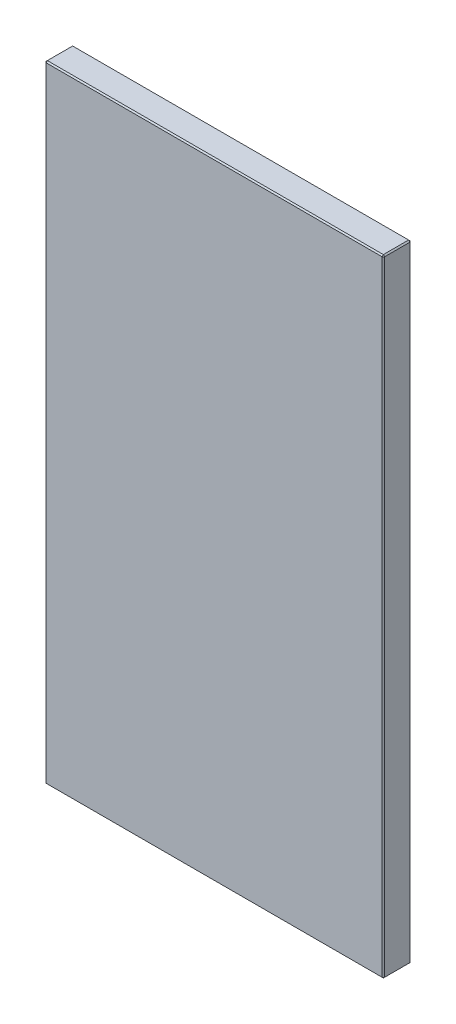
ISO-10303-21;
HEADER;
FILE_DESCRIPTION(('STEP AP214'),'2;1');
FILE_NAME('part.step','',(''),(''),'','','');
FILE_SCHEMA(('AUTOMOTIVE_DESIGN { 1 0 10303 214 1 1 1 1 }'));
ENDSEC;
DATA;
#1=APPLICATION_CONTEXT('core data for automotive mechanical design processes');
#2=APPLICATION_PROTOCOL_DEFINITION('international standard','automotive_design',2000,#1);
#3=PRODUCT_CONTEXT('',#1,'mechanical');
#4=PRODUCT('Part','Part','',(#3));
#5=PRODUCT_RELATED_PRODUCT_CATEGORY('part','',(#4));
#6=PRODUCT_DEFINITION_FORMATION('','',#4);
#7=PRODUCT_DEFINITION_CONTEXT('part definition',#1,'design');
#8=PRODUCT_DEFINITION('design','',#6,#7);
#9=PRODUCT_DEFINITION_SHAPE('','',#8);
#10=(LENGTH_UNIT() NAMED_UNIT(*) SI_UNIT(.MILLI.,.METRE.));
#11=(NAMED_UNIT(*) PLANE_ANGLE_UNIT() SI_UNIT($,.RADIAN.));
#12=(NAMED_UNIT(*) SI_UNIT($,.STERADIAN.) SOLID_ANGLE_UNIT());
#13=UNCERTAINTY_MEASURE_WITH_UNIT(LENGTH_MEASURE(1.E-05),#10,'distance_accuracy_value','');
#14=(GEOMETRIC_REPRESENTATION_CONTEXT(3) GLOBAL_UNCERTAINTY_ASSIGNED_CONTEXT((#13)) GLOBAL_UNIT_ASSIGNED_CONTEXT((#10,
#11,#12)) REPRESENTATION_CONTEXT('',''));
#15=CARTESIAN_POINT('',(0.,0.,0.));
#16=DIRECTION('',(0.,0.,1.));
#17=DIRECTION('',(1.,0.,0.));
#18=AXIS2_PLACEMENT_3D('',#15,#16,#17);
#19=CARTESIAN_POINT('',(-134.,-248.,22.));
#20=DIRECTION('',(1.,0.,0.));
#21=DIRECTION('',(0.,0.,-1.));
#22=AXIS2_PLACEMENT_3D('',#19,#20,#21);
#23=PLANE('',#22);
#24=DIRECTION('',(0.,0.,-1.));
#25=VECTOR('',#24,1.);
#26=CARTESIAN_POINT('',(-134.,247.,22.));
#27=LINE('',#26,#25);
#28=CARTESIAN_POINT('',(-134.,247.,21.));
#29=VERTEX_POINT('',#28);
#30=CARTESIAN_POINT('',(-134.,247.,1.));
#31=VERTEX_POINT('',#30);
#32=EDGE_CURVE('E114',#29,#31,#27,.T.);
#33=ORIENTED_EDGE('',*,*,#32,.T.);
#34=DIRECTION('',(0.,-1.,0.));
#35=VECTOR('',#34,1.);
#36=CARTESIAN_POINT('',(-134.,-248.,1.));
#37=LINE('',#36,#35);
#38=CARTESIAN_POINT('',(-134.,-247.,1.));
#39=VERTEX_POINT('',#38);
#40=EDGE_CURVE('E110',#31,#39,#37,.T.);
#41=ORIENTED_EDGE('',*,*,#40,.T.);
#42=DIRECTION('',(0.,0.,1.));
#43=VECTOR('',#42,1.);
#44=CARTESIAN_POINT('',(-134.,-247.,22.));
#45=LINE('',#44,#43);
#46=CARTESIAN_POINT('',(-134.,-247.,21.));
#47=VERTEX_POINT('',#46);
#48=EDGE_CURVE('E103',#39,#47,#45,.T.);
#49=ORIENTED_EDGE('',*,*,#48,.T.);
#50=DIRECTION('',(0.,1.,0.));
#51=VECTOR('',#50,1.);
#52=CARTESIAN_POINT('',(-134.,248.,21.));
#53=LINE('',#52,#51);
#54=EDGE_CURVE('E107',#47,#29,#53,.T.);
#55=ORIENTED_EDGE('',*,*,#54,.T.);
#56=EDGE_LOOP('',(#33,#41,#49,#55));
#57=FACE_BOUND('',#56,.T.);
#58=ADVANCED_FACE('F15',(#57),#23,.F.);
#59=CARTESIAN_POINT('',(134.,-248.,22.));
#60=DIRECTION('',(0.,1.,0.));
#61=DIRECTION('',(-1.,0.,0.));
#62=AXIS2_PLACEMENT_3D('',#59,#60,#61);
#63=PLANE('',#62);
#64=DIRECTION('',(0.,0.,-1.));
#65=VECTOR('',#64,1.);
#66=CARTESIAN_POINT('',(-133.,-248.,22.));
#67=LINE('',#66,#65);
#68=CARTESIAN_POINT('',(-133.,-248.,21.));
#69=VERTEX_POINT('',#68);
#70=CARTESIAN_POINT('',(-133.,-248.,1.));
#71=VERTEX_POINT('',#70);
#72=EDGE_CURVE('E122',#69,#71,#67,.T.);
#73=ORIENTED_EDGE('',*,*,#72,.T.);
#74=DIRECTION('',(1.,0.,0.));
#75=VECTOR('',#74,1.);
#76=CARTESIAN_POINT('',(134.,-248.,1.));
#77=LINE('',#76,#75);
#78=CARTESIAN_POINT('',(133.,-248.,1.));
#79=VERTEX_POINT('',#78);
#80=EDGE_CURVE('E160',#71,#79,#77,.T.);
#81=ORIENTED_EDGE('',*,*,#80,.T.);
#82=DIRECTION('',(0.,0.,1.));
#83=VECTOR('',#82,1.);
#84=CARTESIAN_POINT('',(133.,-248.,22.));
#85=LINE('',#84,#83);
#86=CARTESIAN_POINT('',(133.,-248.,21.));
#87=VERTEX_POINT('',#86);
#88=EDGE_CURVE('E157',#79,#87,#85,.T.);
#89=ORIENTED_EDGE('',*,*,#88,.T.);
#90=DIRECTION('',(-1.,0.,0.));
#91=VECTOR('',#90,1.);
#92=CARTESIAN_POINT('',(-134.,-248.,21.));
#93=LINE('',#92,#91);
#94=EDGE_CURVE('E155',#87,#69,#93,.T.);
#95=ORIENTED_EDGE('',*,*,#94,.T.);
#96=EDGE_LOOP('',(#73,#81,#89,#95));
#97=FACE_BOUND('',#96,.T.);
#98=ADVANCED_FACE('F277',(#97),#63,.F.);
#99=CARTESIAN_POINT('',(134.,-248.,22.));
#100=DIRECTION('',(-1.,0.,0.));
#101=DIRECTION('',(0.,0.,1.));
#102=AXIS2_PLACEMENT_3D('',#99,#100,#101);
#103=PLANE('',#102);
#104=DIRECTION('',(0.,-1.,0.));
#105=VECTOR('',#104,1.);
#106=CARTESIAN_POINT('',(134.,-248.,21.));
#107=LINE('',#106,#105);
#108=CARTESIAN_POINT('',(134.,247.,21.));
#109=VERTEX_POINT('',#108);
#110=CARTESIAN_POINT('',(134.,-247.,21.));
#111=VERTEX_POINT('',#110);
#112=EDGE_CURVE('E162',#109,#111,#107,.T.);
#113=ORIENTED_EDGE('',*,*,#112,.T.);
#114=DIRECTION('',(0.,0.,-1.));
#115=VECTOR('',#114,1.);
#116=CARTESIAN_POINT('',(134.,-247.,22.));
#117=LINE('',#116,#115);
#118=CARTESIAN_POINT('',(134.,-247.,1.));
#119=VERTEX_POINT('',#118);
#120=EDGE_CURVE('E168',#111,#119,#117,.T.);
#121=ORIENTED_EDGE('',*,*,#120,.T.);
#122=DIRECTION('',(0.,1.,0.));
#123=VECTOR('',#122,1.);
#124=CARTESIAN_POINT('',(134.,-248.,1.));
#125=LINE('',#124,#123);
#126=CARTESIAN_POINT('',(134.,247.,1.));
#127=VERTEX_POINT('',#126);
#128=EDGE_CURVE('E166',#119,#127,#125,.T.);
#129=ORIENTED_EDGE('',*,*,#128,.T.);
#130=DIRECTION('',(0.,0.,1.));
#131=VECTOR('',#130,1.);
#132=CARTESIAN_POINT('',(134.,247.,22.));
#133=LINE('',#132,#131);
#134=EDGE_CURVE('E164',#127,#109,#133,.T.);
#135=ORIENTED_EDGE('',*,*,#134,.T.);
#136=EDGE_LOOP('',(#113,#121,#129,#135));
#137=FACE_BOUND('',#136,.T.);
#138=ADVANCED_FACE('F254',(#137),#103,.F.);
#139=CARTESIAN_POINT('',(134.,248.,22.));
#140=DIRECTION('',(0.,-1.,0.));
#141=DIRECTION('',(1.,0.,0.));
#142=AXIS2_PLACEMENT_3D('',#139,#140,#141);
#143=PLANE('',#142);
#144=DIRECTION('',(-1.,0.,0.));
#145=VECTOR('',#144,1.);
#146=CARTESIAN_POINT('',(134.,248.,1.));
#147=LINE('',#146,#145);
#148=CARTESIAN_POINT('',(133.,248.,1.));
#149=VERTEX_POINT('',#148);
#150=CARTESIAN_POINT('',(-133.,248.,1.));
#151=VERTEX_POINT('',#150);
#152=EDGE_CURVE('E150',#149,#151,#147,.T.);
#153=ORIENTED_EDGE('',*,*,#152,.T.);
#154=DIRECTION('',(0.,0.,1.));
#155=VECTOR('',#154,1.);
#156=CARTESIAN_POINT('',(-133.,248.,22.));
#157=LINE('',#156,#155);
#158=CARTESIAN_POINT('',(-133.,248.,21.));
#159=VERTEX_POINT('',#158);
#160=EDGE_CURVE('E152',#151,#159,#157,.T.);
#161=ORIENTED_EDGE('',*,*,#160,.T.);
#162=DIRECTION('',(1.,0.,0.));
#163=VECTOR('',#162,1.);
#164=CARTESIAN_POINT('',(134.,248.,21.));
#165=LINE('',#164,#163);
#166=CARTESIAN_POINT('',(133.,248.,21.));
#167=VERTEX_POINT('',#166);
#168=EDGE_CURVE('E146',#159,#167,#165,.T.);
#169=ORIENTED_EDGE('',*,*,#168,.T.);
#170=DIRECTION('',(0.,0.,-1.));
#171=VECTOR('',#170,1.);
#172=CARTESIAN_POINT('',(133.,248.,22.));
#173=LINE('',#172,#171);
#174=EDGE_CURVE('E148',#167,#149,#173,.T.);
#175=ORIENTED_EDGE('',*,*,#174,.T.);
#176=EDGE_LOOP('',(#153,#161,#169,#175));
#177=FACE_BOUND('',#176,.T.);
#178=ADVANCED_FACE('F286',(#177),#143,.F.);
#179=CARTESIAN_POINT('',(0.,0.,22.));
#180=DIRECTION('',(0.,0.,1.));
#181=DIRECTION('',(1.,0.,0.));
#182=AXIS2_PLACEMENT_3D('',#179,#180,#181);
#183=PLANE('',#182);
#184=DIRECTION('',(0.,1.,0.));
#185=VECTOR('',#184,1.);
#186=CARTESIAN_POINT('',(133.,248.,22.));
#187=LINE('',#186,#185);
#188=CARTESIAN_POINT('',(133.,-247.,22.));
#189=VERTEX_POINT('',#188);
#190=CARTESIAN_POINT('',(133.,247.,22.));
#191=VERTEX_POINT('',#190);
#192=EDGE_CURVE('E24',#189,#191,#187,.T.);
#193=ORIENTED_EDGE('',*,*,#192,.T.);
#194=DIRECTION('',(-1.,0.,0.));
#195=VECTOR('',#194,1.);
#196=CARTESIAN_POINT('',(-134.,247.,22.));
#197=LINE('',#196,#195);
#198=CARTESIAN_POINT('',(-133.,247.,22.));
#199=VERTEX_POINT('',#198);
#200=EDGE_CURVE('E9',#191,#199,#197,.T.);
#201=ORIENTED_EDGE('',*,*,#200,.T.);
#202=DIRECTION('',(0.,-1.,0.));
#203=VECTOR('',#202,1.);
#204=CARTESIAN_POINT('',(-133.,-248.,22.));
#205=LINE('',#204,#203);
#206=CARTESIAN_POINT('',(-133.,-247.,22.));
#207=VERTEX_POINT('',#206);
#208=EDGE_CURVE('E180',#199,#207,#205,.T.);
#209=ORIENTED_EDGE('',*,*,#208,.T.);
#210=DIRECTION('',(1.,0.,0.));
#211=VECTOR('',#210,1.);
#212=CARTESIAN_POINT('',(134.,-247.,22.));
#213=LINE('',#212,#211);
#214=EDGE_CURVE('E35',#207,#189,#213,.T.);
#215=ORIENTED_EDGE('',*,*,#214,.T.);
#216=EDGE_LOOP('',(#193,#201,#209,#215));
#217=FACE_BOUND('',#216,.T.);
#218=ADVANCED_FACE('F351',(#217),#183,.T.);
#219=CARTESIAN_POINT('',(0.,0.,0.));
#220=DIRECTION('',(0.,0.,1.));
#221=DIRECTION('',(1.,0.,0.));
#222=AXIS2_PLACEMENT_3D('',#219,#220,#221);
#223=PLANE('',#222);
#224=DIRECTION('',(0.,-1.,0.));
#225=VECTOR('',#224,1.);
#226=CARTESIAN_POINT('',(133.,0.,0.));
#227=LINE('',#226,#225);
#228=CARTESIAN_POINT('',(133.,247.,0.));
#229=VERTEX_POINT('',#228);
#230=CARTESIAN_POINT('',(133.,-247.,0.));
#231=VERTEX_POINT('',#230);
#232=EDGE_CURVE('E175',#229,#231,#227,.T.);
#233=ORIENTED_EDGE('',*,*,#232,.T.);
#234=DIRECTION('',(-1.,0.,0.));
#235=VECTOR('',#234,1.);
#236=CARTESIAN_POINT('',(0.,-247.,0.));
#237=LINE('',#236,#235);
#238=CARTESIAN_POINT('',(-133.,-247.,0.));
#239=VERTEX_POINT('',#238);
#240=EDGE_CURVE('E177',#231,#239,#237,.T.);
#241=ORIENTED_EDGE('',*,*,#240,.T.);
#242=DIRECTION('',(0.,1.,0.));
#243=VECTOR('',#242,1.);
#244=CARTESIAN_POINT('',(-133.,0.,0.));
#245=LINE('',#244,#243);
#246=CARTESIAN_POINT('',(-133.,247.,0.));
#247=VERTEX_POINT('',#246);
#248=EDGE_CURVE('E173',#239,#247,#245,.T.);
#249=ORIENTED_EDGE('',*,*,#248,.T.);
#250=DIRECTION('',(1.,0.,0.));
#251=VECTOR('',#250,1.);
#252=CARTESIAN_POINT('',(0.,247.,0.));
#253=LINE('',#252,#251);
#254=EDGE_CURVE('E171',#247,#229,#253,.T.);
#255=ORIENTED_EDGE('',*,*,#254,.T.);
#256=EDGE_LOOP('',(#233,#241,#249,#255));
#257=FACE_BOUND('',#256,.T.);
#258=ADVANCED_FACE('F246',(#257),#223,.F.);
#259=CARTESIAN_POINT('',(134.,-247.,22.));
#260=DIRECTION('',(-0.707106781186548,0.707106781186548,0.));
#261=DIRECTION('',(0.,0.,-1.));
#262=AXIS2_PLACEMENT_3D('',#259,#260,#261);
#263=PLANE('',#262);
#264=DIRECTION('',(-0.707106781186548,-0.707106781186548,0.));
#265=VECTOR('',#264,1.);
#266=CARTESIAN_POINT('',(133.,-248.,21.));
#267=LINE('',#266,#265);
#268=EDGE_CURVE('E19',#87,#111,#267,.F.);
#269=ORIENTED_EDGE('',*,*,#268,.F.);
#270=ORIENTED_EDGE('',*,*,#88,.F.);
#271=DIRECTION('',(0.707106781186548,0.707106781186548,0.));
#272=VECTOR('',#271,1.);
#273=CARTESIAN_POINT('',(134.,-247.,1.));
#274=LINE('',#273,#272);
#275=EDGE_CURVE('E142',#119,#79,#274,.F.);
#276=ORIENTED_EDGE('',*,*,#275,.F.);
#277=ORIENTED_EDGE('',*,*,#120,.F.);
#278=EDGE_LOOP('',(#269,#270,#276,#277));
#279=FACE_BOUND('',#278,.T.);
#280=ADVANCED_FACE('F17',(#279),#263,.F.);
#281=CARTESIAN_POINT('',(133.,-248.,21.));
#282=DIRECTION('',(0.577350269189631,-0.577350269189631,0.577350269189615));
#283=DIRECTION('',(0.707106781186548,0.707106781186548,0.));
#284=AXIS2_PLACEMENT_3D('',#281,#282,#283);
#285=PLANE('',#284);
#286=DIRECTION('',(0.,-0.707106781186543,-0.707106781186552));
#287=VECTOR('',#286,1.);
#288=CARTESIAN_POINT('',(133.,-248.,21.));
#289=LINE('',#288,#287);
#290=EDGE_CURVE('E227',#87,#189,#289,.F.);
#291=ORIENTED_EDGE('',*,*,#290,.F.);
#292=ORIENTED_EDGE('',*,*,#268,.T.);
#293=DIRECTION('',(-0.707106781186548,0.,0.707106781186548));
#294=VECTOR('',#293,1.);
#295=CARTESIAN_POINT('',(133.5,-247.,21.5));
#296=LINE('',#295,#294);
#297=EDGE_CURVE('E229',#189,#111,#296,.F.);
#298=ORIENTED_EDGE('',*,*,#297,.F.);
#299=EDGE_LOOP('',(#291,#292,#298));
#300=FACE_BOUND('',#299,.T.);
#301=ADVANCED_FACE('F272',(#300),#285,.T.);
#302=CARTESIAN_POINT('',(134.,-247.,1.));
#303=DIRECTION('',(0.577350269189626,-0.577350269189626,-0.577350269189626));
#304=DIRECTION('',(-0.707106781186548,0.,-0.707106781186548));
#305=AXIS2_PLACEMENT_3D('',#302,#303,#304);
#306=PLANE('',#305);
#307=DIRECTION('',(-0.707106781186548,0.,-0.707106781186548));
#308=VECTOR('',#307,1.);
#309=CARTESIAN_POINT('',(134.,-247.,1.));
#310=LINE('',#309,#308);
#311=EDGE_CURVE('E221',#119,#231,#310,.T.);
#312=ORIENTED_EDGE('',*,*,#311,.F.);
#313=ORIENTED_EDGE('',*,*,#275,.T.);
#314=DIRECTION('',(0.,-0.707106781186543,0.707106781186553));
#315=VECTOR('',#314,1.);
#316=CARTESIAN_POINT('',(133.,-247.5,0.500000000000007));
#317=LINE('',#316,#315);
#318=EDGE_CURVE('E224',#231,#79,#317,.T.);
#319=ORIENTED_EDGE('',*,*,#318,.F.);
#320=EDGE_LOOP('',(#312,#313,#319));
#321=FACE_BOUND('',#320,.T.);
#322=ADVANCED_FACE('F236',(#321),#306,.T.);
#323=CARTESIAN_POINT('',(133.,0.,22.));
#324=DIRECTION('',(0.707106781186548,0.,0.707106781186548));
#325=DIRECTION('',(0.,-1.,0.));
#326=AXIS2_PLACEMENT_3D('',#323,#324,#325);
#327=PLANE('',#326);
#328=ORIENTED_EDGE('',*,*,#297,.T.);
#329=ORIENTED_EDGE('',*,*,#112,.F.);
#330=DIRECTION('',(0.707106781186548,0.,-0.707106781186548));
#331=VECTOR('',#330,1.);
#332=CARTESIAN_POINT('',(134.,247.,21.));
#333=LINE('',#332,#331);
#334=EDGE_CURVE('E215',#191,#109,#333,.T.);
#335=ORIENTED_EDGE('',*,*,#334,.F.);
#336=ORIENTED_EDGE('',*,*,#192,.F.);
#337=EDGE_LOOP('',(#328,#329,#335,#336));
#338=FACE_BOUND('',#337,.T.);
#339=ADVANCED_FACE('F267',(#338),#327,.T.);
#340=CARTESIAN_POINT('',(0.,-247.,22.));
#341=DIRECTION('',(0.,-0.707106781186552,0.707106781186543));
#342=DIRECTION('',(-1.,0.,0.));
#343=AXIS2_PLACEMENT_3D('',#340,#341,#342);
#344=PLANE('',#343);
#345=ORIENTED_EDGE('',*,*,#290,.T.);
#346=ORIENTED_EDGE('',*,*,#214,.F.);
#347=DIRECTION('',(0.,0.707106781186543,0.707106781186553));
#348=VECTOR('',#347,1.);
#349=CARTESIAN_POINT('',(-133.,-247.5,21.5));
#350=LINE('',#349,#348);
#351=EDGE_CURVE('E126',#69,#207,#350,.T.);
#352=ORIENTED_EDGE('',*,*,#351,.F.);
#353=ORIENTED_EDGE('',*,*,#94,.F.);
#354=EDGE_LOOP('',(#345,#346,#352,#353));
#355=FACE_BOUND('',#354,.T.);
#356=ADVANCED_FACE('F275',(#355),#344,.T.);
#357=CARTESIAN_POINT('',(-133.,-248.,22.));
#358=DIRECTION('',(0.707106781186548,0.707106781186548,0.));
#359=DIRECTION('',(0.,0.,-1.));
#360=AXIS2_PLACEMENT_3D('',#357,#358,#359);
#361=PLANE('',#360);
#362=DIRECTION('',(0.707106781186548,-0.707106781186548,0.));
#363=VECTOR('',#362,1.);
#364=CARTESIAN_POINT('',(-133.,-248.,1.));
#365=LINE('',#364,#363);
#366=EDGE_CURVE('E127',#71,#39,#365,.F.);
#367=ORIENTED_EDGE('',*,*,#366,.F.);
#368=ORIENTED_EDGE('',*,*,#72,.F.);
#369=DIRECTION('',(-0.707106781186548,0.707106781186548,0.));
#370=VECTOR('',#369,1.);
#371=CARTESIAN_POINT('',(-134.,-247.,21.));
#372=LINE('',#371,#370);
#373=EDGE_CURVE('E118',#47,#69,#372,.F.);
#374=ORIENTED_EDGE('',*,*,#373,.F.);
#375=ORIENTED_EDGE('',*,*,#48,.F.);
#376=EDGE_LOOP('',(#367,#368,#374,#375));
#377=FACE_BOUND('',#376,.T.);
#378=ADVANCED_FACE('F120',(#377),#361,.F.);
#379=CARTESIAN_POINT('',(134.,-248.,1.));
#380=DIRECTION('',(0.,0.707106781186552,0.707106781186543));
#381=DIRECTION('',(1.,0.,0.));
#382=AXIS2_PLACEMENT_3D('',#379,#380,#381);
#383=PLANE('',#382);
#384=ORIENTED_EDGE('',*,*,#318,.T.);
#385=ORIENTED_EDGE('',*,*,#80,.F.);
#386=DIRECTION('',(0.,0.707106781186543,-0.707106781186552));
#387=VECTOR('',#386,1.);
#388=CARTESIAN_POINT('',(-133.,-248.,1.));
#389=LINE('',#388,#387);
#390=EDGE_CURVE('E211',#239,#71,#389,.F.);
#391=ORIENTED_EDGE('',*,*,#390,.F.);
#392=ORIENTED_EDGE('',*,*,#240,.F.);
#393=EDGE_LOOP('',(#384,#385,#391,#392));
#394=FACE_BOUND('',#393,.T.);
#395=ADVANCED_FACE('F243',(#394),#383,.F.);
#396=CARTESIAN_POINT('',(134.,-248.,1.));
#397=DIRECTION('',(-0.707106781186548,0.,0.707106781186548));
#398=DIRECTION('',(0.,1.,0.));
#399=AXIS2_PLACEMENT_3D('',#396,#397,#398);
#400=PLANE('',#399);
#401=ORIENTED_EDGE('',*,*,#311,.T.);
#402=ORIENTED_EDGE('',*,*,#232,.F.);
#403=DIRECTION('',(0.707106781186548,0.,0.707106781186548));
#404=VECTOR('',#403,1.);
#405=CARTESIAN_POINT('',(134.,247.,1.));
#406=LINE('',#405,#404);
#407=EDGE_CURVE('E208',#127,#229,#406,.F.);
#408=ORIENTED_EDGE('',*,*,#407,.F.);
#409=ORIENTED_EDGE('',*,*,#128,.F.);
#410=EDGE_LOOP('',(#401,#402,#408,#409));
#411=FACE_BOUND('',#410,.T.);
#412=ADVANCED_FACE('F251',(#411),#400,.F.);
#413=CARTESIAN_POINT('',(133.,248.,22.));
#414=DIRECTION('',(-0.707106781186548,-0.707106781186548,0.));
#415=DIRECTION('',(0.,0.,-1.));
#416=AXIS2_PLACEMENT_3D('',#413,#414,#415);
#417=PLANE('',#416);
#418=DIRECTION('',(0.707106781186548,-0.707106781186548,0.));
#419=VECTOR('',#418,1.);
#420=CARTESIAN_POINT('',(134.,247.,21.));
#421=LINE('',#420,#419);
#422=EDGE_CURVE('E218',#109,#167,#421,.F.);
#423=ORIENTED_EDGE('',*,*,#422,.F.);
#424=ORIENTED_EDGE('',*,*,#134,.F.);
#425=DIRECTION('',(-0.707106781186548,0.707106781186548,0.));
#426=VECTOR('',#425,1.);
#427=CARTESIAN_POINT('',(134.,247.,1.));
#428=LINE('',#427,#426);
#429=EDGE_CURVE('E205',#149,#127,#428,.F.);
#430=ORIENTED_EDGE('',*,*,#429,.F.);
#431=ORIENTED_EDGE('',*,*,#174,.F.);
#432=EDGE_LOOP('',(#423,#424,#430,#431));
#433=FACE_BOUND('',#432,.T.);
#434=ADVANCED_FACE('F259',(#433),#417,.F.);
#435=CARTESIAN_POINT('',(134.,247.,21.));
#436=DIRECTION('',(0.577350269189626,0.577350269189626,0.577350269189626));
#437=DIRECTION('',(0.707106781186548,0.,-0.707106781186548));
#438=AXIS2_PLACEMENT_3D('',#435,#436,#437);
#439=PLANE('',#438);
#440=ORIENTED_EDGE('',*,*,#334,.T.);
#441=ORIENTED_EDGE('',*,*,#422,.T.);
#442=DIRECTION('',(0.,-0.707106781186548,0.707106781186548));
#443=VECTOR('',#442,1.);
#444=CARTESIAN_POINT('',(133.,247.5,21.5));
#445=LINE('',#444,#443);
#446=EDGE_CURVE('E134',#191,#167,#445,.F.);
#447=ORIENTED_EDGE('',*,*,#446,.F.);
#448=EDGE_LOOP('',(#440,#441,#447));
#449=FACE_BOUND('',#448,.T.);
#450=ADVANCED_FACE('F264',(#449),#439,.T.);
#451=CARTESIAN_POINT('',(-134.,-247.,21.));
#452=DIRECTION('',(-0.577350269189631,-0.577350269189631,0.577350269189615));
#453=DIRECTION('',(0.707106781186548,-0.707106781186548,0.));
#454=AXIS2_PLACEMENT_3D('',#451,#452,#453);
#455=PLANE('',#454);
#456=ORIENTED_EDGE('',*,*,#373,.T.);
#457=ORIENTED_EDGE('',*,*,#351,.T.);
#458=DIRECTION('',(-0.707106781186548,0.,-0.707106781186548));
#459=VECTOR('',#458,1.);
#460=CARTESIAN_POINT('',(-134.,-247.,21.));
#461=LINE('',#460,#459);
#462=EDGE_CURVE('E130',#47,#207,#461,.F.);
#463=ORIENTED_EDGE('',*,*,#462,.F.);
#464=EDGE_LOOP('',(#456,#457,#463));
#465=FACE_BOUND('',#464,.T.);
#466=ADVANCED_FACE('F131',(#465),#455,.T.);
#467=CARTESIAN_POINT('',(-133.,-248.,1.));
#468=DIRECTION('',(-0.577350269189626,-0.577350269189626,-0.577350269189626));
#469=DIRECTION('',(-0.707106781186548,0.,0.707106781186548));
#470=AXIS2_PLACEMENT_3D('',#467,#468,#469);
#471=PLANE('',#470);
#472=ORIENTED_EDGE('',*,*,#390,.T.);
#473=ORIENTED_EDGE('',*,*,#366,.T.);
#474=DIRECTION('',(-0.707106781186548,0.,0.707106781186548));
#475=VECTOR('',#474,1.);
#476=CARTESIAN_POINT('',(-133.5,-247.,0.5));
#477=LINE('',#476,#475);
#478=EDGE_CURVE('E135',#239,#39,#477,.T.);
#479=ORIENTED_EDGE('',*,*,#478,.F.);
#480=EDGE_LOOP('',(#472,#473,#479));
#481=FACE_BOUND('',#480,.T.);
#482=ADVANCED_FACE('F320',(#481),#471,.T.);
#483=CARTESIAN_POINT('',(134.,247.,1.));
#484=DIRECTION('',(0.577350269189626,0.577350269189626,-0.577350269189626));
#485=DIRECTION('',(-0.707106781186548,0.,-0.707106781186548));
#486=AXIS2_PLACEMENT_3D('',#483,#484,#485);
#487=PLANE('',#486);
#488=ORIENTED_EDGE('',*,*,#429,.T.);
#489=ORIENTED_EDGE('',*,*,#407,.T.);
#490=DIRECTION('',(0.,-0.707106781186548,-0.707106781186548));
#491=VECTOR('',#490,1.);
#492=CARTESIAN_POINT('',(133.,247.5,0.5));
#493=LINE('',#492,#491);
#494=EDGE_CURVE('E198',#149,#229,#493,.T.);
#495=ORIENTED_EDGE('',*,*,#494,.F.);
#496=EDGE_LOOP('',(#488,#489,#495));
#497=FACE_BOUND('',#496,.T.);
#498=ADVANCED_FACE('F316',(#497),#487,.T.);
#499=CARTESIAN_POINT('',(0.,247.,22.));
#500=DIRECTION('',(0.,0.707106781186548,0.707106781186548));
#501=DIRECTION('',(1.,0.,0.));
#502=AXIS2_PLACEMENT_3D('',#499,#500,#501);
#503=PLANE('',#502);
#504=ORIENTED_EDGE('',*,*,#446,.T.);
#505=ORIENTED_EDGE('',*,*,#168,.F.);
#506=DIRECTION('',(0.,0.707106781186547,-0.707106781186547));
#507=VECTOR('',#506,1.);
#508=CARTESIAN_POINT('',(-133.,248.,21.));
#509=LINE('',#508,#507);
#510=EDGE_CURVE('E195',#199,#159,#509,.T.);
#511=ORIENTED_EDGE('',*,*,#510,.F.);
#512=ORIENTED_EDGE('',*,*,#200,.F.);
#513=EDGE_LOOP('',(#504,#505,#511,#512));
#514=FACE_BOUND('',#513,.T.);
#515=ADVANCED_FACE('F313',(#514),#503,.T.);
#516=CARTESIAN_POINT('',(-133.,0.,22.));
#517=DIRECTION('',(-0.707106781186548,0.,0.707106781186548));
#518=DIRECTION('',(0.,1.,0.));
#519=AXIS2_PLACEMENT_3D('',#516,#517,#518);
#520=PLANE('',#519);
#521=ORIENTED_EDGE('',*,*,#462,.T.);
#522=ORIENTED_EDGE('',*,*,#208,.F.);
#523=DIRECTION('',(0.707106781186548,0.,0.707106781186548));
#524=VECTOR('',#523,1.);
#525=CARTESIAN_POINT('',(-133.5,247.,21.5));
#526=LINE('',#525,#524);
#527=EDGE_CURVE('E138',#29,#199,#526,.T.);
#528=ORIENTED_EDGE('',*,*,#527,.F.);
#529=ORIENTED_EDGE('',*,*,#54,.F.);
#530=EDGE_LOOP('',(#521,#522,#528,#529));
#531=FACE_BOUND('',#530,.T.);
#532=ADVANCED_FACE('F137',(#531),#520,.T.);
#533=CARTESIAN_POINT('',(-134.,-248.,1.));
#534=DIRECTION('',(0.707106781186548,0.,0.707106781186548));
#535=DIRECTION('',(0.,-1.,0.));
#536=AXIS2_PLACEMENT_3D('',#533,#534,#535);
#537=PLANE('',#536);
#538=ORIENTED_EDGE('',*,*,#478,.T.);
#539=ORIENTED_EDGE('',*,*,#40,.F.);
#540=DIRECTION('',(0.707106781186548,0.,-0.707106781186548));
#541=VECTOR('',#540,1.);
#542=CARTESIAN_POINT('',(-134.,247.,1.));
#543=LINE('',#542,#541);
#544=EDGE_CURVE('E191',#247,#31,#543,.F.);
#545=ORIENTED_EDGE('',*,*,#544,.F.);
#546=ORIENTED_EDGE('',*,*,#248,.F.);
#547=EDGE_LOOP('',(#538,#539,#545,#546));
#548=FACE_BOUND('',#547,.T.);
#549=ADVANCED_FACE('F306',(#548),#537,.F.);
#550=CARTESIAN_POINT('',(134.,248.,1.));
#551=DIRECTION('',(0.,-0.707106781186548,0.707106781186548));
#552=DIRECTION('',(-1.,0.,0.));
#553=AXIS2_PLACEMENT_3D('',#550,#551,#552);
#554=PLANE('',#553);
#555=ORIENTED_EDGE('',*,*,#494,.T.);
#556=ORIENTED_EDGE('',*,*,#254,.F.);
#557=DIRECTION('',(0.,0.707106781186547,0.707106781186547));
#558=VECTOR('',#557,1.);
#559=CARTESIAN_POINT('',(-133.,247.5,0.499999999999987));
#560=LINE('',#559,#558);
#561=EDGE_CURVE('E188',#151,#247,#560,.F.);
#562=ORIENTED_EDGE('',*,*,#561,.F.);
#563=ORIENTED_EDGE('',*,*,#152,.F.);
#564=EDGE_LOOP('',(#555,#556,#562,#563));
#565=FACE_BOUND('',#564,.T.);
#566=ADVANCED_FACE('F302',(#565),#554,.F.);
#567=CARTESIAN_POINT('',(-133.,248.,21.));
#568=DIRECTION('',(-0.577350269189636,0.57735026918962,0.57735026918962));
#569=DIRECTION('',(0.707106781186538,0.,0.707106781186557));
#570=AXIS2_PLACEMENT_3D('',#567,#568,#569);
#571=PLANE('',#570);
#572=ORIENTED_EDGE('',*,*,#527,.T.);
#573=ORIENTED_EDGE('',*,*,#510,.T.);
#574=DIRECTION('',(0.707106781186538,0.707106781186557,0.));
#575=VECTOR('',#574,1.);
#576=CARTESIAN_POINT('',(-133.,248.,21.));
#577=LINE('',#576,#575);
#578=EDGE_CURVE('E186',#29,#159,#577,.T.);
#579=ORIENTED_EDGE('',*,*,#578,.F.);
#580=EDGE_LOOP('',(#572,#573,#579));
#581=FACE_BOUND('',#580,.T.);
#582=ADVANCED_FACE('F298',(#581),#571,.T.);
#583=CARTESIAN_POINT('',(-134.,247.,1.));
#584=DIRECTION('',(-0.577350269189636,0.57735026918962,-0.57735026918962));
#585=DIRECTION('',(-0.707106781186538,0.,0.707106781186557));
#586=AXIS2_PLACEMENT_3D('',#583,#584,#585);
#587=PLANE('',#586);
#588=ORIENTED_EDGE('',*,*,#561,.T.);
#589=ORIENTED_EDGE('',*,*,#544,.T.);
#590=DIRECTION('',(-0.707106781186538,-0.707106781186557,0.));
#591=VECTOR('',#590,1.);
#592=CARTESIAN_POINT('',(-134.,247.,1.));
#593=LINE('',#592,#591);
#594=EDGE_CURVE('E184',#151,#31,#593,.T.);
#595=ORIENTED_EDGE('',*,*,#594,.F.);
#596=EDGE_LOOP('',(#588,#589,#595));
#597=FACE_BOUND('',#596,.T.);
#598=ADVANCED_FACE('F294',(#597),#587,.T.);
#599=CARTESIAN_POINT('',(-134.,247.,22.));
#600=DIRECTION('',(0.707106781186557,-0.707106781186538,0.));
#601=DIRECTION('',(0.,0.,-1.));
#602=AXIS2_PLACEMENT_3D('',#599,#600,#601);
#603=PLANE('',#602);
#604=ORIENTED_EDGE('',*,*,#578,.T.);
#605=ORIENTED_EDGE('',*,*,#160,.F.);
#606=ORIENTED_EDGE('',*,*,#594,.T.);
#607=ORIENTED_EDGE('',*,*,#32,.F.);
#608=EDGE_LOOP('',(#604,#605,#606,#607));
#609=FACE_BOUND('',#608,.T.);
#610=ADVANCED_FACE('F291',(#609),#603,.F.);
#611=CLOSED_SHELL('',(#58,#98,#138,#178,#218,#258,#280,#301,#322,#339,#356,#378,#395,#412,#434,
#450,#466,#482,#498,#515,#532,#549,#566,#582,#598,#610));
#612=MANIFOLD_SOLID_BREP('B1',#611);
#613=ADVANCED_BREP_SHAPE_REPRESENTATION('',(#18,#612),#14);
#614=SHAPE_DEFINITION_REPRESENTATION(#9,#613);
ENDSEC;
END-ISO-10303-21;
